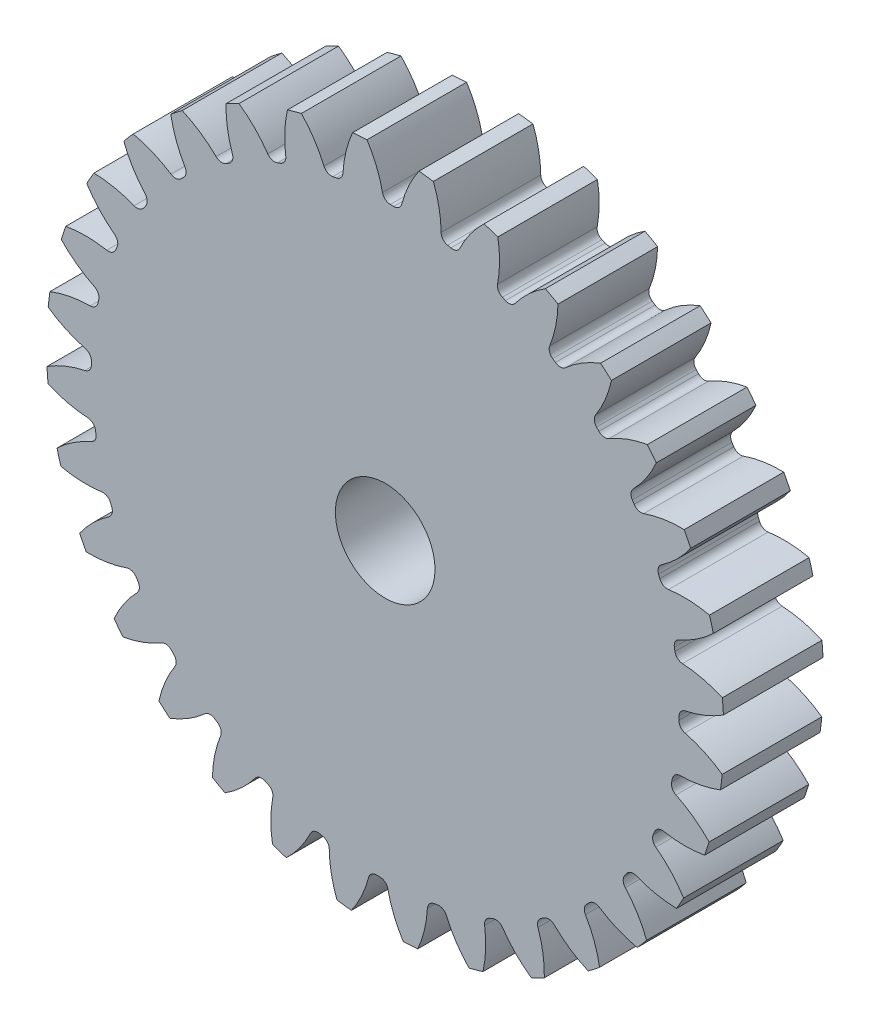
from build123d import *

# Parameters (mm, degrees)
SKETCH3_R         = 345.44
GEARBODY_DEPTH    = 101.6
TOOTHCUT_DEPTH    = 499.979104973
CIRPATTERN1_COUNT = 32
BOREDIA_R         = 50.8
BORE_DEPTH        = 12700


with BuildPart() as part:
    # Sketch3 → gearBody (new body)
    with BuildSketch(Plane.XY):
        Circle(SKETCH3_R)
    extrude(amount=GEARBODY_DEPTH)

    # Sketch2 → toothCut (cut, through all)
    with BuildSketch(Plane.XY):
        with BuildLine():
            ThreePointArc((299.594574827, -8.670013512), (299.639867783, -6.930226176), (299.675057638, -5.190205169))
            ThreePointArc((299.675057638, -5.190205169), (301.56831499, -0.065898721), (306.243437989, 2.760081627))
            ThreePointArc((306.243437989, 2.760081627), (326.578971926, 9.01570823), (345.44, 18.860931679))
            ThreePointArc((345.44, 18.860931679), (345.862024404, -7.999276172), (344.198641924, -34.811251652))
            ThreePointArc((344.198641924, -34.811251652), (325.81294904, -24.104566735), (305.788371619, -16.915470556))
            ThreePointArc((305.788371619, -16.915470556), (301.248899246, -13.87637027), (299.594574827, -8.670013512))
        make_face()
    toothcut = extrude(amount=TOOTHCUT_DEPTH, mode=Mode.SUBTRACT)

    # CirPattern1: toothCut ×32 about axis
    cirpattern1_axis = Axis((0, 0, 0), (0, 0, 1))
    for i in range(1, CIRPATTERN1_COUNT):
        add(toothcut.rotate(cirpattern1_axis, i * 360 / CIRPATTERN1_COUNT), mode=Mode.SUBTRACT)

    # boreDia → bore (cut, symmetric)
    with BuildSketch(Plane.XY):
        Circle(BOREDIA_R)
    extrude(amount=BORE_DEPTH, both=True, mode=Mode.SUBTRACT)


solid = part.part
